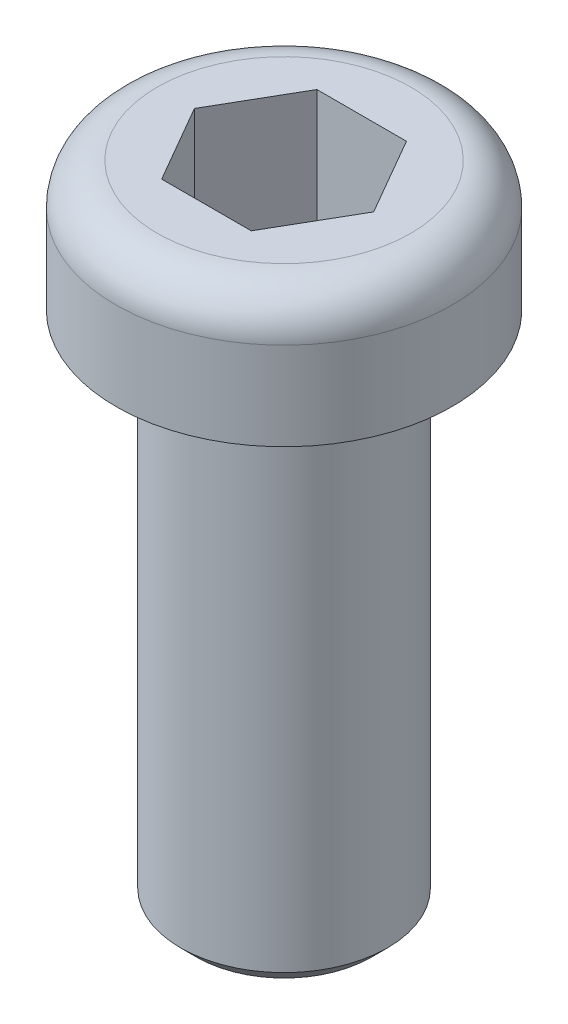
ISO-10303-21;
HEADER;
FILE_DESCRIPTION(('STEP AP214'),'2;1');
FILE_NAME('part.step','',(''),(''),'','','');
FILE_SCHEMA(('AUTOMOTIVE_DESIGN { 1 0 10303 214 1 1 1 1 }'));
ENDSEC;
DATA;
#1=APPLICATION_CONTEXT('core data for automotive mechanical design processes');
#2=APPLICATION_PROTOCOL_DEFINITION('international standard','automotive_design',2000,#1);
#3=PRODUCT_CONTEXT('',#1,'mechanical');
#4=PRODUCT('Part','Part','',(#3));
#5=PRODUCT_RELATED_PRODUCT_CATEGORY('part','',(#4));
#6=PRODUCT_DEFINITION_FORMATION('','',#4);
#7=PRODUCT_DEFINITION_CONTEXT('part definition',#1,'design');
#8=PRODUCT_DEFINITION('design','',#6,#7);
#9=PRODUCT_DEFINITION_SHAPE('','',#8);
#10=(LENGTH_UNIT() NAMED_UNIT(*) SI_UNIT(.MILLI.,.METRE.));
#11=(NAMED_UNIT(*) PLANE_ANGLE_UNIT() SI_UNIT($,.RADIAN.));
#12=(NAMED_UNIT(*) SI_UNIT($,.STERADIAN.) SOLID_ANGLE_UNIT());
#13=UNCERTAINTY_MEASURE_WITH_UNIT(LENGTH_MEASURE(1.E-05),#10,'distance_accuracy_value','');
#14=(GEOMETRIC_REPRESENTATION_CONTEXT(3) GLOBAL_UNCERTAINTY_ASSIGNED_CONTEXT((#13)) GLOBAL_UNIT_ASSIGNED_CONTEXT((#10,
#11,#12)) REPRESENTATION_CONTEXT('',''));
#15=CARTESIAN_POINT('',(0.,0.,0.));
#16=DIRECTION('',(0.,0.,1.));
#17=DIRECTION('',(1.,0.,0.));
#18=AXIS2_PLACEMENT_3D('',#15,#16,#17);
#19=CARTESIAN_POINT('',(0.,5.,0.));
#20=DIRECTION('',(0.,-1.,0.));
#21=DIRECTION('',(1.,0.,0.));
#22=AXIS2_PLACEMENT_3D('',#19,#20,#21);
#23=PLANE('',#22);
#24=DIRECTION('',(-0.5,0.,-0.866025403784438));
#25=VECTOR('',#24,1.);
#26=CARTESIAN_POINT('',(3.46410161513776,5.,0.));
#27=LINE('',#26,#25);
#28=CARTESIAN_POINT('',(3.46410161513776,5.,0.));
#29=VERTEX_POINT('',#28);
#30=CARTESIAN_POINT('',(1.73205080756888,5.,-3.));
#31=VERTEX_POINT('',#30);
#32=EDGE_CURVE('E140',#29,#31,#27,.T.);
#33=ORIENTED_EDGE('',*,*,#32,.F.);
#34=DIRECTION('',(0.5,0.,-0.866025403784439));
#35=VECTOR('',#34,1.);
#36=CARTESIAN_POINT('',(1.73205080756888,5.,3.));
#37=LINE('',#36,#35);
#38=CARTESIAN_POINT('',(1.73205080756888,5.,3.));
#39=VERTEX_POINT('',#38);
#40=EDGE_CURVE('E54',#39,#29,#37,.T.);
#41=ORIENTED_EDGE('',*,*,#40,.F.);
#42=DIRECTION('',(1.,0.,0.));
#43=VECTOR('',#42,1.);
#44=CARTESIAN_POINT('',(-1.73205080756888,5.,3.));
#45=LINE('',#44,#43);
#46=CARTESIAN_POINT('',(-1.73205080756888,5.,3.));
#47=VERTEX_POINT('',#46);
#48=EDGE_CURVE('E152',#47,#39,#45,.T.);
#49=ORIENTED_EDGE('',*,*,#48,.F.);
#50=DIRECTION('',(0.5,0.,0.866025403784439));
#51=VECTOR('',#50,1.);
#52=CARTESIAN_POINT('',(-3.46410161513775,5.,0.));
#53=LINE('',#52,#51);
#54=CARTESIAN_POINT('',(-3.46410161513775,5.,0.));
#55=VERTEX_POINT('',#54);
#56=EDGE_CURVE('E150',#55,#47,#53,.T.);
#57=ORIENTED_EDGE('',*,*,#56,.F.);
#58=DIRECTION('',(-0.5,0.,0.866025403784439));
#59=VECTOR('',#58,1.);
#60=CARTESIAN_POINT('',(-1.73205080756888,5.,-3.));
#61=LINE('',#60,#59);
#62=CARTESIAN_POINT('',(-1.73205080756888,5.,-3.));
#63=VERTEX_POINT('',#62);
#64=EDGE_CURVE('E108',#63,#55,#61,.T.);
#65=ORIENTED_EDGE('',*,*,#64,.F.);
#66=DIRECTION('',(-1.,0.,0.));
#67=VECTOR('',#66,1.);
#68=CARTESIAN_POINT('',(1.73205080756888,5.,-3.));
#69=LINE('',#68,#67);
#70=EDGE_CURVE('E144',#31,#63,#69,.T.);
#71=ORIENTED_EDGE('',*,*,#70,.F.);
#72=EDGE_LOOP('',(#33,#41,#49,#57,#65,#71));
#73=FACE_BOUND('',#72,.T.);
#74=CARTESIAN_POINT('',(0.,5.,0.));
#75=DIRECTION('',(0.,1.,0.));
#76=DIRECTION('',(-1.,0.,0.));
#77=AXIS2_PLACEMENT_3D('',#74,#75,#76);
#78=CIRCLE('',#77,4.9);
#79=CARTESIAN_POINT('',(-4.9,5.,0.));
#80=VERTEX_POINT('',#79);
#81=EDGE_CURVE('E11',#80,#80,#78,.T.);
#82=ORIENTED_EDGE('',*,*,#81,.T.);
#83=EDGE_LOOP('',(#82));
#84=FACE_BOUND('',#83,.T.);
#85=ADVANCED_FACE('F39',(#73,#84),#23,.F.);
#86=CARTESIAN_POINT('',(0.,3.4,0.));
#87=DIRECTION('',(0.,1.,0.));
#88=DIRECTION('',(-1.,0.,0.));
#89=AXIS2_PLACEMENT_3D('',#86,#87,#88);
#90=TOROIDAL_SURFACE('',#89,4.9,1.6);
#91=ORIENTED_EDGE('',*,*,#81,.F.);
#92=EDGE_LOOP('',(#91));
#93=FACE_BOUND('',#92,.T.);
#94=CARTESIAN_POINT('',(0.,3.4,0.));
#95=DIRECTION('',(0.,1.,0.));
#96=DIRECTION('',(-1.,0.,0.));
#97=AXIS2_PLACEMENT_3D('',#94,#95,#96);
#98=CIRCLE('',#97,6.5);
#99=CARTESIAN_POINT('',(-6.5,3.4,0.));
#100=VERTEX_POINT('',#99);
#101=EDGE_CURVE('E47',#100,#100,#98,.T.);
#102=ORIENTED_EDGE('',*,*,#101,.T.);
#103=EDGE_LOOP('',(#102));
#104=FACE_BOUND('',#103,.T.);
#105=ADVANCED_FACE('F185',(#93,#104),#90,.T.);
#106=CARTESIAN_POINT('',(0.,5.,0.));
#107=DIRECTION('',(0.,1.,0.));
#108=DIRECTION('',(-1.,0.,0.));
#109=AXIS2_PLACEMENT_3D('',#106,#107,#108);
#110=CYLINDRICAL_SURFACE('',#109,6.5);
#111=ORIENTED_EDGE('',*,*,#101,.F.);
#112=EDGE_LOOP('',(#111));
#113=FACE_BOUND('',#112,.T.);
#114=CARTESIAN_POINT('',(0.,0.,0.));
#115=DIRECTION('',(0.,1.,0.));
#116=DIRECTION('',(-1.,0.,0.));
#117=AXIS2_PLACEMENT_3D('',#114,#115,#116);
#118=CIRCLE('',#117,6.5);
#119=CARTESIAN_POINT('',(-6.5,0.,0.));
#120=VERTEX_POINT('',#119);
#121=EDGE_CURVE('E179',#120,#120,#118,.T.);
#122=ORIENTED_EDGE('',*,*,#121,.T.);
#123=EDGE_LOOP('',(#122));
#124=FACE_BOUND('',#123,.T.);
#125=ADVANCED_FACE('F187',(#113,#124),#110,.T.);
#126=CARTESIAN_POINT('',(6.5,0.,0.));
#127=DIRECTION('',(0.,1.,0.));
#128=DIRECTION('',(-1.,0.,0.));
#129=AXIS2_PLACEMENT_3D('',#126,#127,#128);
#130=PLANE('',#129);
#131=ORIENTED_EDGE('',*,*,#121,.F.);
#132=EDGE_LOOP('',(#131));
#133=FACE_BOUND('',#132,.T.);
#134=CARTESIAN_POINT('',(0.,0.,0.));
#135=DIRECTION('',(0.,1.,0.));
#136=DIRECTION('',(-1.,0.,0.));
#137=AXIS2_PLACEMENT_3D('',#134,#135,#136);
#138=CIRCLE('',#137,4.4);
#139=CARTESIAN_POINT('',(-4.4,0.,0.));
#140=VERTEX_POINT('',#139);
#141=EDGE_CURVE('E175',#140,#140,#138,.T.);
#142=ORIENTED_EDGE('',*,*,#141,.T.);
#143=EDGE_LOOP('',(#142));
#144=FACE_BOUND('',#143,.T.);
#145=ADVANCED_FACE('F190',(#133,#144),#130,.F.);
#146=CARTESIAN_POINT('',(0.,-0.4,0.));
#147=DIRECTION('',(0.,1.,0.));
#148=DIRECTION('',(-1.,0.,0.));
#149=AXIS2_PLACEMENT_3D('',#146,#147,#148);
#150=TOROIDAL_SURFACE('',#149,4.4,0.400000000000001);
#151=ORIENTED_EDGE('',*,*,#141,.F.);
#152=EDGE_LOOP('',(#151));
#153=FACE_BOUND('',#152,.T.);
#154=CARTESIAN_POINT('',(0.,-0.4,0.));
#155=DIRECTION('',(0.,1.,0.));
#156=DIRECTION('',(-1.,0.,0.));
#157=AXIS2_PLACEMENT_3D('',#154,#155,#156);
#158=CIRCLE('',#157,4.);
#159=CARTESIAN_POINT('',(-4.,-0.4,0.));
#160=VERTEX_POINT('',#159);
#161=EDGE_CURVE('E171',#160,#160,#158,.T.);
#162=ORIENTED_EDGE('',*,*,#161,.T.);
#163=EDGE_LOOP('',(#162));
#164=FACE_BOUND('',#163,.T.);
#165=ADVANCED_FACE('F196',(#153,#164),#150,.F.);
#166=CARTESIAN_POINT('',(0.,5.,0.));
#167=DIRECTION('',(0.,1.,0.));
#168=DIRECTION('',(-1.,0.,0.));
#169=AXIS2_PLACEMENT_3D('',#166,#167,#168);
#170=CYLINDRICAL_SURFACE('',#169,4.);
#171=ORIENTED_EDGE('',*,*,#161,.F.);
#172=EDGE_LOOP('',(#171));
#173=FACE_BOUND('',#172,.T.);
#174=CARTESIAN_POINT('',(0.,-19.375,0.));
#175=DIRECTION('',(0.,1.,0.));
#176=DIRECTION('',(-1.,0.,0.));
#177=AXIS2_PLACEMENT_3D('',#174,#175,#176);
#178=CIRCLE('',#177,4.);
#179=CARTESIAN_POINT('',(-4.,-19.375,0.));
#180=VERTEX_POINT('',#179);
#181=EDGE_CURVE('E168',#180,#180,#178,.T.);
#182=ORIENTED_EDGE('',*,*,#181,.T.);
#183=EDGE_LOOP('',(#182));
#184=FACE_BOUND('',#183,.T.);
#185=ADVANCED_FACE('F202',(#173,#184),#170,.T.);
#186=CARTESIAN_POINT('',(0.,-20.,0.));
#187=DIRECTION('',(0.,1.,0.));
#188=DIRECTION('',(-1.,0.,0.));
#189=AXIS2_PLACEMENT_3D('',#186,#187,#188);
#190=CONICAL_SURFACE('',#189,3.375,0.785398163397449);
#191=ORIENTED_EDGE('',*,*,#181,.F.);
#192=EDGE_LOOP('',(#191));
#193=FACE_BOUND('',#192,.T.);
#194=CARTESIAN_POINT('',(0.,-20.,0.));
#195=DIRECTION('',(0.,1.,0.));
#196=DIRECTION('',(-1.,0.,0.));
#197=AXIS2_PLACEMENT_3D('',#194,#195,#196);
#198=CIRCLE('',#197,3.375);
#199=CARTESIAN_POINT('',(-3.375,-20.,0.));
#200=VERTEX_POINT('',#199);
#201=EDGE_CURVE('E157',#200,#200,#198,.T.);
#202=ORIENTED_EDGE('',*,*,#201,.T.);
#203=EDGE_LOOP('',(#202));
#204=FACE_BOUND('',#203,.T.);
#205=ADVANCED_FACE('F208',(#193,#204),#190,.T.);
#206=CARTESIAN_POINT('',(3.375,-20.,0.));
#207=DIRECTION('',(0.,1.,0.));
#208=DIRECTION('',(-1.,0.,0.));
#209=AXIS2_PLACEMENT_3D('',#206,#207,#208);
#210=PLANE('',#209);
#211=ORIENTED_EDGE('',*,*,#201,.F.);
#212=EDGE_LOOP('',(#211));
#213=FACE_BOUND('',#212,.T.);
#214=ADVANCED_FACE('F214',(#213),#210,.F.);
#215=CARTESIAN_POINT('',(1.73205080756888,0.,3.));
#216=DIRECTION('',(0.866025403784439,0.,0.5));
#217=DIRECTION('',(0.5,0.,-0.866025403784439));
#218=AXIS2_PLACEMENT_3D('',#215,#216,#217);
#219=PLANE('',#218);
#220=ORIENTED_EDGE('',*,*,#40,.T.);
#221=DIRECTION('',(0.,1.,0.));
#222=VECTOR('',#221,1.);
#223=CARTESIAN_POINT('',(3.46410161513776,0.,0.));
#224=LINE('',#223,#222);
#225=CARTESIAN_POINT('',(3.46410161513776,0.,0.));
#226=VERTEX_POINT('',#225);
#227=EDGE_CURVE('E89',#226,#29,#224,.T.);
#228=ORIENTED_EDGE('',*,*,#227,.F.);
#229=DIRECTION('',(0.5,0.,-0.866025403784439));
#230=VECTOR('',#229,1.);
#231=CARTESIAN_POINT('',(1.73205080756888,0.,3.));
#232=LINE('',#231,#230);
#233=CARTESIAN_POINT('',(1.73205080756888,0.,3.));
#234=VERTEX_POINT('',#233);
#235=EDGE_CURVE('E154',#234,#226,#232,.T.);
#236=ORIENTED_EDGE('',*,*,#235,.F.);
#237=DIRECTION('',(0.,1.,0.));
#238=VECTOR('',#237,1.);
#239=CARTESIAN_POINT('',(1.73205080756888,0.,3.));
#240=LINE('',#239,#238);
#241=EDGE_CURVE('E65',#234,#39,#240,.T.);
#242=ORIENTED_EDGE('',*,*,#241,.T.);
#243=EDGE_LOOP('',(#220,#228,#236,#242));
#244=FACE_BOUND('',#243,.T.);
#245=ADVANCED_FACE('F219',(#244),#219,.F.);
#246=CARTESIAN_POINT('',(-1.73205080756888,0.,3.));
#247=DIRECTION('',(0.,0.,1.));
#248=DIRECTION('',(1.,0.,0.));
#249=AXIS2_PLACEMENT_3D('',#246,#247,#248);
#250=PLANE('',#249);
#251=ORIENTED_EDGE('',*,*,#48,.T.);
#252=ORIENTED_EDGE('',*,*,#241,.F.);
#253=DIRECTION('',(1.,0.,0.));
#254=VECTOR('',#253,1.);
#255=CARTESIAN_POINT('',(-1.73205080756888,0.,3.));
#256=LINE('',#255,#254);
#257=CARTESIAN_POINT('',(-1.73205080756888,0.,3.));
#258=VERTEX_POINT('',#257);
#259=EDGE_CURVE('E122',#258,#234,#256,.T.);
#260=ORIENTED_EDGE('',*,*,#259,.F.);
#261=DIRECTION('',(0.,1.,0.));
#262=VECTOR('',#261,1.);
#263=CARTESIAN_POINT('',(-1.73205080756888,0.,3.));
#264=LINE('',#263,#262);
#265=EDGE_CURVE('E113',#258,#47,#264,.T.);
#266=ORIENTED_EDGE('',*,*,#265,.T.);
#267=EDGE_LOOP('',(#251,#252,#260,#266));
#268=FACE_BOUND('',#267,.T.);
#269=ADVANCED_FACE('F224',(#268),#250,.F.);
#270=CARTESIAN_POINT('',(-3.46410161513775,0.,0.));
#271=DIRECTION('',(-0.866025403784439,0.,0.5));
#272=DIRECTION('',(0.5,0.,0.866025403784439));
#273=AXIS2_PLACEMENT_3D('',#270,#271,#272);
#274=PLANE('',#273);
#275=ORIENTED_EDGE('',*,*,#56,.T.);
#276=ORIENTED_EDGE('',*,*,#265,.F.);
#277=DIRECTION('',(0.5,0.,0.866025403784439));
#278=VECTOR('',#277,1.);
#279=CARTESIAN_POINT('',(-3.46410161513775,0.,0.));
#280=LINE('',#279,#278);
#281=CARTESIAN_POINT('',(-3.46410161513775,0.,0.));
#282=VERTEX_POINT('',#281);
#283=EDGE_CURVE('E117',#282,#258,#280,.T.);
#284=ORIENTED_EDGE('',*,*,#283,.F.);
#285=DIRECTION('',(0.,1.,0.));
#286=VECTOR('',#285,1.);
#287=CARTESIAN_POINT('',(-3.46410161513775,0.,0.));
#288=LINE('',#287,#286);
#289=EDGE_CURVE('E101',#282,#55,#288,.T.);
#290=ORIENTED_EDGE('',*,*,#289,.T.);
#291=EDGE_LOOP('',(#275,#276,#284,#290));
#292=FACE_BOUND('',#291,.T.);
#293=ADVANCED_FACE('F118',(#292),#274,.F.);
#294=CARTESIAN_POINT('',(-1.73205080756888,0.,-3.));
#295=DIRECTION('',(-0.866025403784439,0.,-0.5));
#296=DIRECTION('',(-0.5,0.,0.866025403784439));
#297=AXIS2_PLACEMENT_3D('',#294,#295,#296);
#298=PLANE('',#297);
#299=ORIENTED_EDGE('',*,*,#64,.T.);
#300=ORIENTED_EDGE('',*,*,#289,.F.);
#301=DIRECTION('',(-0.5,0.,0.866025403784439));
#302=VECTOR('',#301,1.);
#303=CARTESIAN_POINT('',(-1.73205080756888,0.,-3.));
#304=LINE('',#303,#302);
#305=CARTESIAN_POINT('',(-1.73205080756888,0.,-3.));
#306=VERTEX_POINT('',#305);
#307=EDGE_CURVE('E105',#306,#282,#304,.T.);
#308=ORIENTED_EDGE('',*,*,#307,.F.);
#309=DIRECTION('',(0.,1.,0.));
#310=VECTOR('',#309,1.);
#311=CARTESIAN_POINT('',(-1.73205080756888,0.,-3.));
#312=LINE('',#311,#310);
#313=EDGE_CURVE('E114',#306,#63,#312,.T.);
#314=ORIENTED_EDGE('',*,*,#313,.T.);
#315=EDGE_LOOP('',(#299,#300,#308,#314));
#316=FACE_BOUND('',#315,.T.);
#317=ADVANCED_FACE('F103',(#316),#298,.F.);
#318=CARTESIAN_POINT('',(1.73205080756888,0.,-3.));
#319=DIRECTION('',(0.,0.,-1.));
#320=DIRECTION('',(-1.,0.,0.));
#321=AXIS2_PLACEMENT_3D('',#318,#319,#320);
#322=PLANE('',#321);
#323=ORIENTED_EDGE('',*,*,#70,.T.);
#324=ORIENTED_EDGE('',*,*,#313,.F.);
#325=DIRECTION('',(-1.,0.,0.));
#326=VECTOR('',#325,1.);
#327=CARTESIAN_POINT('',(1.73205080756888,0.,-3.));
#328=LINE('',#327,#326);
#329=CARTESIAN_POINT('',(1.73205080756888,0.,-3.));
#330=VERTEX_POINT('',#329);
#331=EDGE_CURVE('E128',#330,#306,#328,.T.);
#332=ORIENTED_EDGE('',*,*,#331,.F.);
#333=DIRECTION('',(0.,1.,0.));
#334=VECTOR('',#333,1.);
#335=CARTESIAN_POINT('',(1.73205080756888,0.,-3.));
#336=LINE('',#335,#334);
#337=EDGE_CURVE('E162',#330,#31,#336,.T.);
#338=ORIENTED_EDGE('',*,*,#337,.T.);
#339=EDGE_LOOP('',(#323,#324,#332,#338));
#340=FACE_BOUND('',#339,.T.);
#341=ADVANCED_FACE('F252',(#340),#322,.F.);
#342=CARTESIAN_POINT('',(3.46410161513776,0.,0.));
#343=DIRECTION('',(0.866025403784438,0.,-0.5));
#344=DIRECTION('',(-0.5,0.,-0.866025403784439));
#345=AXIS2_PLACEMENT_3D('',#342,#343,#344);
#346=PLANE('',#345);
#347=ORIENTED_EDGE('',*,*,#32,.T.);
#348=ORIENTED_EDGE('',*,*,#337,.F.);
#349=DIRECTION('',(-0.5,0.,-0.866025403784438));
#350=VECTOR('',#349,1.);
#351=CARTESIAN_POINT('',(3.46410161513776,0.,0.));
#352=LINE('',#351,#350);
#353=EDGE_CURVE('E133',#226,#330,#352,.T.);
#354=ORIENTED_EDGE('',*,*,#353,.F.);
#355=ORIENTED_EDGE('',*,*,#227,.T.);
#356=EDGE_LOOP('',(#347,#348,#354,#355));
#357=FACE_BOUND('',#356,.T.);
#358=ADVANCED_FACE('F238',(#357),#346,.F.);
#359=CARTESIAN_POINT('',(1.73205080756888,0.,3.));
#360=DIRECTION('',(0.,-1.,0.));
#361=DIRECTION('',(0.,0.,-1.));
#362=AXIS2_PLACEMENT_3D('',#359,#360,#361);
#363=PLANE('',#362);
#364=ORIENTED_EDGE('',*,*,#235,.T.);
#365=ORIENTED_EDGE('',*,*,#353,.T.);
#366=ORIENTED_EDGE('',*,*,#331,.T.);
#367=ORIENTED_EDGE('',*,*,#307,.T.);
#368=ORIENTED_EDGE('',*,*,#283,.T.);
#369=ORIENTED_EDGE('',*,*,#259,.T.);
#370=EDGE_LOOP('',(#364,#365,#366,#367,#368,#369));
#371=FACE_BOUND('',#370,.T.);
#372=ADVANCED_FACE('F125',(#371),#363,.F.);
#373=CLOSED_SHELL('',(#85,#105,#125,#145,#165,#185,#205,#214,#245,#269,#293,#317,#341,#358,#372));
#374=MANIFOLD_SOLID_BREP('B2',#373);
#375=ADVANCED_BREP_SHAPE_REPRESENTATION('',(#18,#374),#14);
#376=SHAPE_DEFINITION_REPRESENTATION(#9,#375);
ENDSEC;
END-ISO-10303-21;
